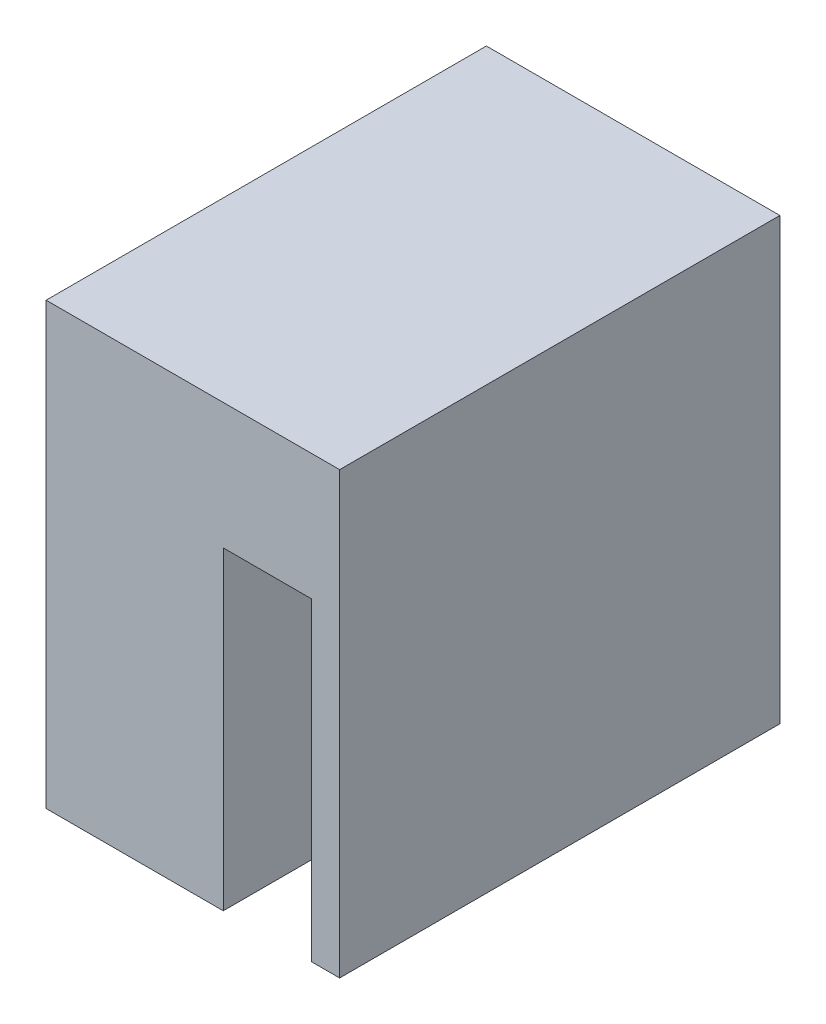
from build123d import *

# Parameters (mm, degrees)
BOSS_EXTRU_2_DEPTH      = 15
ESQUISSE2_R             = 5.006948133
ENL_V_MAT_EXTRU_1_DEPTH = 3


with BuildPart() as part:
    # Esquisse1 → Boss.-Extru.2 (new body)
    with BuildSketch(Plane.XY):
        Polygon((0, 15), (0, 0), (6.03538733, 0), (6.03538733, 10.708888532), (9.03538733, 10.708888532), (9.03538733, 0), (10, 0), (10, 15), align=None)
    extrude(amount=-BOSS_EXTRU_2_DEPTH)

    # Esquisse2 → Enl_v. mat.-Extru.1 (cut)
    with BuildSketch(Plane.ZY):
        with Locations((-7.5, 7.5)):
            Circle(ESQUISSE2_R)
    extrude(amount=-ENL_V_MAT_EXTRU_1_DEPTH, mode=Mode.SUBTRACT)


solid = part.part
